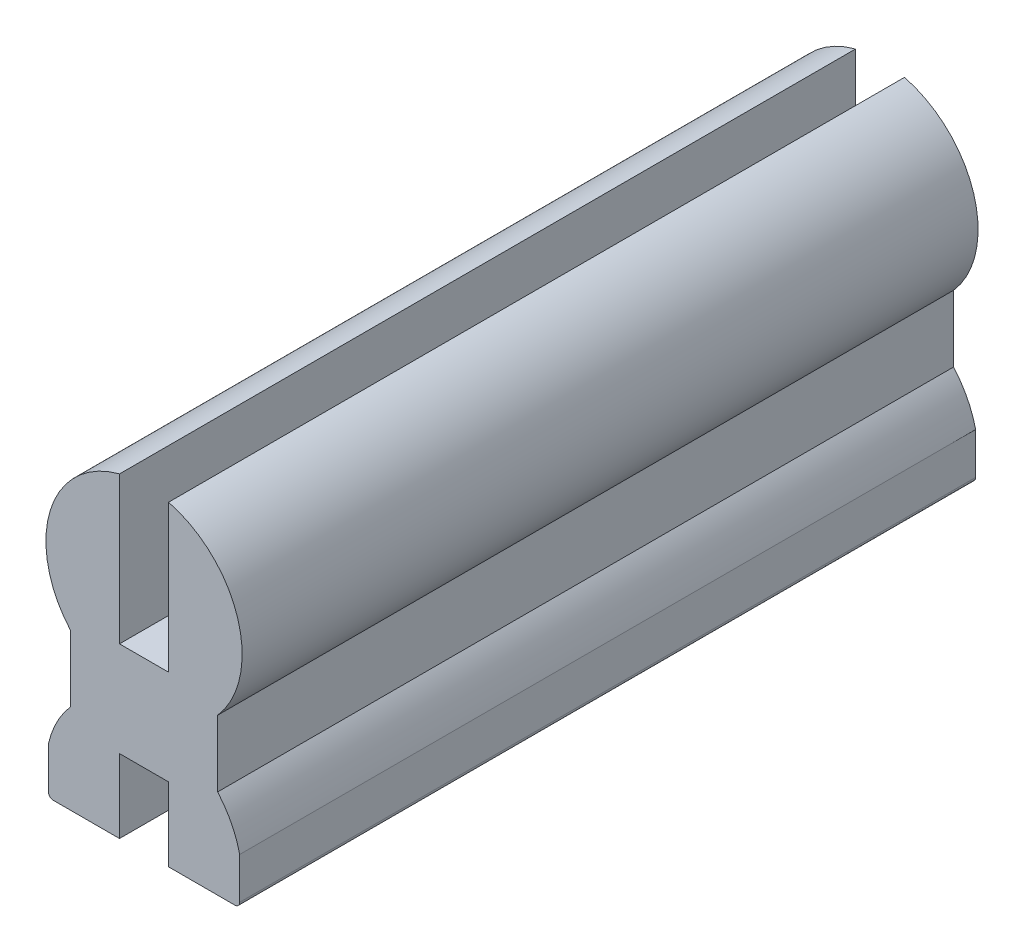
from build123d import *

# Parameters (mm, degrees)
EXTRUDE_1_DEPTH = 15
FILLET_1_R      = 0.1


with BuildPart() as part:
    # Sketch 1 → Extrude 1 (new body)
    with BuildSketch(Plane.XY):
        with BuildLine():
            Line((-1.95, -2.5), (-0.5, -2.5))
            Line((-0.5, -2.5), (-0.5, -1))
            Line((-0.5, -1), (0.5, -1))
            Line((0.5, -1), (0.5, -2.5))
            Line((0.5, -2.5), (1.95, -2.5))
            Line((1.95, -2.5), (1.95, -1.555590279))
            ThreePointArc((1.95, -1.555590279), (1.780042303, -1.088161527), (1.5, -0.677124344))
            Line((1.5, -0.677124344), (1.5, 0.677124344))
            ThreePointArc((1.5, 0.677124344), (1.912032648, 2.586626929), (0.5, 3.936491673))
            Line((0.5, 3.936491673), (0.5, 0.936491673))
            Line((0.5, 0.936491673), (-0.5, 0.936491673))
            Line((-0.5, 0.936491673), (-0.5, 3.936491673))
            ThreePointArc((-0.5, 3.936491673), (-1.912032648, 2.586626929), (-1.5, 0.677124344))
            Line((-1.5, 0.677124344), (-1.5, -0.677124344))
            ThreePointArc((-1.5, -0.677124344), (-1.780042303, -1.088161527), (-1.95, -1.555590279))
            Line((-1.95, -1.555590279), (-1.95, -2.5))
        make_face()
    extrude(amount=-EXTRUDE_1_DEPTH)

    # Fillet 1
    fillet_1_edges = [part.edges().sort_by_distance(p)[0] for p in [
        (1.95, -2.5, -7.5),
        (-1.95, -2.5, -7.5),
    ]]
    fillet(fillet_1_edges, radius=FILLET_1_R)


solid = part.part
